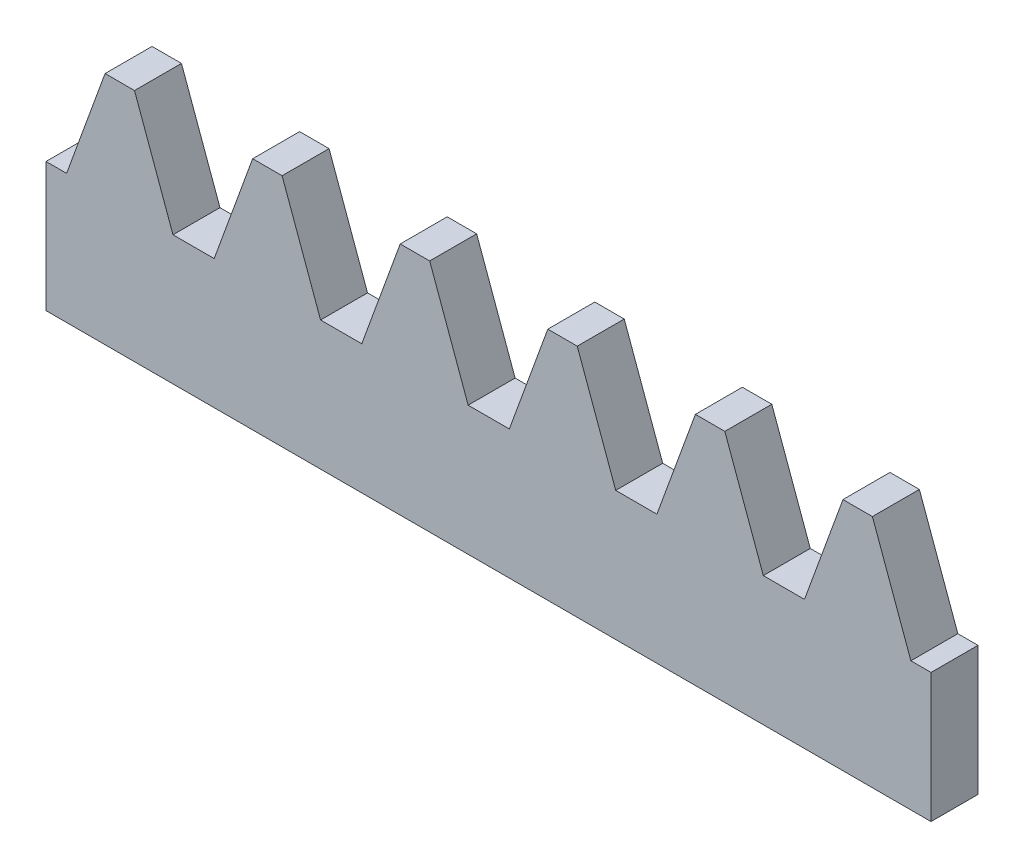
from build123d import *

# Parameters (mm, degrees)
BLANKSKE_W        = 119.634
BLANKSKE_H        = 31.75
BLANK_DEPTH       = 6.35
TOOTHCUTSIM_DEPTH = 124.9382062
TEETHCUTS_COUNT   = 7
TEETHCUTS_PITCH   = 19.949113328


with BuildPart() as part:
    # BlankSke → Blank (new body)
    with BuildSketch(Plane.XY):
        with Locations((59.817, 15.875)):
            Rectangle(BLANKSKE_W, BLANKSKE_H)
    extrude(amount=-BLANK_DEPTH)

    # TooCutSkeSim → ToothCutSim (cut, through all)
    with BuildSketch(Plane.XY):
        Polygon((2.784064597, 17.4625), (-2.784064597, 17.4625), (-7.993534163, 31.7754), (7.993534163, 31.7754), align=None)
    toothcutsim = extrude(amount=-TOOTHCUTSIM_DEPTH, mode=Mode.SUBTRACT)

    # TeethCuts: ToothCutSim ×7
    with Locations(*[(i * TEETHCUTS_PITCH, 0, 0) for i in range(1, TEETHCUTS_COUNT)]):
        add(toothcutsim, mode=Mode.SUBTRACT)


solid = part.part
